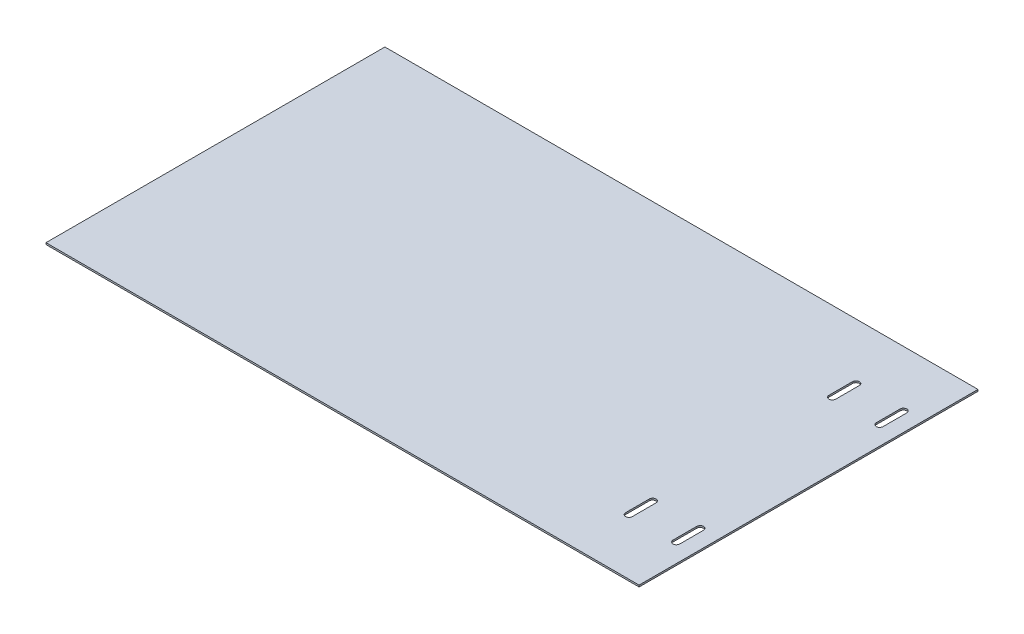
ISO-10303-21;
HEADER;
FILE_DESCRIPTION(('STEP AP214'),'2;1');
FILE_NAME('part.step','',(''),(''),'','','');
FILE_SCHEMA(('AUTOMOTIVE_DESIGN { 1 0 10303 214 1 1 1 1 }'));
ENDSEC;
DATA;
#1=APPLICATION_CONTEXT('core data for automotive mechanical design processes');
#2=APPLICATION_PROTOCOL_DEFINITION('international standard','automotive_design',2000,#1);
#3=PRODUCT_CONTEXT('',#1,'mechanical');
#4=PRODUCT('Part','Part','',(#3));
#5=PRODUCT_RELATED_PRODUCT_CATEGORY('part','',(#4));
#6=PRODUCT_DEFINITION_FORMATION('','',#4);
#7=PRODUCT_DEFINITION_CONTEXT('part definition',#1,'design');
#8=PRODUCT_DEFINITION('design','',#6,#7);
#9=PRODUCT_DEFINITION_SHAPE('','',#8);
#10=(LENGTH_UNIT() NAMED_UNIT(*) SI_UNIT(.MILLI.,.METRE.));
#11=(NAMED_UNIT(*) PLANE_ANGLE_UNIT() SI_UNIT($,.RADIAN.));
#12=(NAMED_UNIT(*) SI_UNIT($,.STERADIAN.) SOLID_ANGLE_UNIT());
#13=UNCERTAINTY_MEASURE_WITH_UNIT(LENGTH_MEASURE(1.E-05),#10,'distance_accuracy_value','');
#14=(GEOMETRIC_REPRESENTATION_CONTEXT(3) GLOBAL_UNCERTAINTY_ASSIGNED_CONTEXT((#13)) GLOBAL_UNIT_ASSIGNED_CONTEXT((#10,
#11,#12)) REPRESENTATION_CONTEXT('',''));
#15=CARTESIAN_POINT('',(0.,0.,0.));
#16=DIRECTION('',(0.,0.,1.));
#17=DIRECTION('',(1.,0.,0.));
#18=AXIS2_PLACEMENT_3D('',#15,#16,#17);
#19=CARTESIAN_POINT('',(176.119348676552,1.,100.));
#20=DIRECTION('',(-1.,0.,0.));
#21=DIRECTION('',(0.,0.,1.));
#22=AXIS2_PLACEMENT_3D('',#19,#20,#21);
#23=PLANE('',#22);
#24=DIRECTION('',(0.,0.,-1.));
#25=VECTOR('',#24,1.);
#26=CARTESIAN_POINT('',(176.119348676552,0.,100.));
#27=LINE('',#26,#25);
#28=CARTESIAN_POINT('',(176.119348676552,0.,100.));
#29=VERTEX_POINT('',#28);
#30=CARTESIAN_POINT('',(176.119348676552,0.,-100.));
#31=VERTEX_POINT('',#30);
#32=EDGE_CURVE('E303',#29,#31,#27,.T.);
#33=ORIENTED_EDGE('',*,*,#32,.T.);
#34=DIRECTION('',(0.,-1.,0.));
#35=VECTOR('',#34,1.);
#36=CARTESIAN_POINT('',(176.119348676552,1.,-100.));
#37=LINE('',#36,#35);
#38=CARTESIAN_POINT('',(176.119348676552,1.,-100.));
#39=VERTEX_POINT('',#38);
#40=EDGE_CURVE('E11',#39,#31,#37,.T.);
#41=ORIENTED_EDGE('',*,*,#40,.F.);
#42=DIRECTION('',(0.,0.,-1.));
#43=VECTOR('',#42,1.);
#44=CARTESIAN_POINT('',(176.119348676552,1.,100.));
#45=LINE('',#44,#43);
#46=CARTESIAN_POINT('',(176.119348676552,1.,100.));
#47=VERTEX_POINT('',#46);
#48=EDGE_CURVE('E310',#47,#39,#45,.T.);
#49=ORIENTED_EDGE('',*,*,#48,.F.);
#50=DIRECTION('',(0.,-1.,0.));
#51=VECTOR('',#50,1.);
#52=CARTESIAN_POINT('',(176.119348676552,1.,100.));
#53=LINE('',#52,#51);
#54=EDGE_CURVE('E320',#47,#29,#53,.T.);
#55=ORIENTED_EDGE('',*,*,#54,.T.);
#56=EDGE_LOOP('',(#33,#41,#49,#55));
#57=FACE_BOUND('',#56,.T.);
#58=ADVANCED_FACE('F42',(#57),#23,.F.);
#59=CARTESIAN_POINT('',(176.119348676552,1.,-100.));
#60=DIRECTION('',(0.,0.,1.));
#61=DIRECTION('',(1.,0.,0.));
#62=AXIS2_PLACEMENT_3D('',#59,#60,#61);
#63=PLANE('',#62);
#64=DIRECTION('',(-1.,0.,0.));
#65=VECTOR('',#64,1.);
#66=CARTESIAN_POINT('',(176.119348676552,0.,-100.));
#67=LINE('',#66,#65);
#68=CARTESIAN_POINT('',(-173.880651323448,0.,-100.));
#69=VERTEX_POINT('',#68);
#70=EDGE_CURVE('E323',#31,#69,#67,.T.);
#71=ORIENTED_EDGE('',*,*,#70,.T.);
#72=DIRECTION('',(0.,-1.,0.));
#73=VECTOR('',#72,1.);
#74=CARTESIAN_POINT('',(-173.880651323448,1.,-100.));
#75=LINE('',#74,#73);
#76=CARTESIAN_POINT('',(-173.880651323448,1.,-100.));
#77=VERTEX_POINT('',#76);
#78=EDGE_CURVE('E49',#77,#69,#75,.T.);
#79=ORIENTED_EDGE('',*,*,#78,.F.);
#80=DIRECTION('',(-1.,0.,0.));
#81=VECTOR('',#80,1.);
#82=CARTESIAN_POINT('',(176.119348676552,1.,-100.));
#83=LINE('',#82,#81);
#84=EDGE_CURVE('E313',#39,#77,#83,.T.);
#85=ORIENTED_EDGE('',*,*,#84,.F.);
#86=ORIENTED_EDGE('',*,*,#40,.T.);
#87=EDGE_LOOP('',(#71,#79,#85,#86));
#88=FACE_BOUND('',#87,.T.);
#89=ADVANCED_FACE('F352',(#88),#63,.F.);
#90=CARTESIAN_POINT('',(-173.880651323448,1.,-100.));
#91=DIRECTION('',(1.,0.,0.));
#92=DIRECTION('',(0.,0.,-1.));
#93=AXIS2_PLACEMENT_3D('',#90,#91,#92);
#94=PLANE('',#93);
#95=DIRECTION('',(0.,0.,1.));
#96=VECTOR('',#95,1.);
#97=CARTESIAN_POINT('',(-173.880651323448,0.,-100.));
#98=LINE('',#97,#96);
#99=CARTESIAN_POINT('',(-173.880651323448,0.,100.));
#100=VERTEX_POINT('',#99);
#101=EDGE_CURVE('E325',#69,#100,#98,.T.);
#102=ORIENTED_EDGE('',*,*,#101,.T.);
#103=DIRECTION('',(0.,-1.,0.));
#104=VECTOR('',#103,1.);
#105=CARTESIAN_POINT('',(-173.880651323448,1.,100.));
#106=LINE('',#105,#104);
#107=CARTESIAN_POINT('',(-173.880651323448,1.,100.));
#108=VERTEX_POINT('',#107);
#109=EDGE_CURVE('E330',#108,#100,#106,.T.);
#110=ORIENTED_EDGE('',*,*,#109,.F.);
#111=DIRECTION('',(0.,0.,1.));
#112=VECTOR('',#111,1.);
#113=CARTESIAN_POINT('',(-173.880651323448,1.,-100.));
#114=LINE('',#113,#112);
#115=EDGE_CURVE('E316',#77,#108,#114,.T.);
#116=ORIENTED_EDGE('',*,*,#115,.F.);
#117=ORIENTED_EDGE('',*,*,#78,.T.);
#118=EDGE_LOOP('',(#102,#110,#116,#117));
#119=FACE_BOUND('',#118,.T.);
#120=ADVANCED_FACE('F337',(#119),#94,.F.);
#121=CARTESIAN_POINT('',(-173.880651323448,1.,100.));
#122=DIRECTION('',(0.,0.,-1.));
#123=DIRECTION('',(-1.,0.,0.));
#124=AXIS2_PLACEMENT_3D('',#121,#122,#123);
#125=PLANE('',#124);
#126=DIRECTION('',(1.,0.,0.));
#127=VECTOR('',#126,1.);
#128=CARTESIAN_POINT('',(-173.880651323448,0.,100.));
#129=LINE('',#128,#127);
#130=EDGE_CURVE('E314',#100,#29,#129,.T.);
#131=ORIENTED_EDGE('',*,*,#130,.T.);
#132=ORIENTED_EDGE('',*,*,#54,.F.);
#133=DIRECTION('',(1.,0.,0.));
#134=VECTOR('',#133,1.);
#135=CARTESIAN_POINT('',(-173.880651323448,1.,100.));
#136=LINE('',#135,#134);
#137=EDGE_CURVE('E318',#108,#47,#136,.T.);
#138=ORIENTED_EDGE('',*,*,#137,.F.);
#139=ORIENTED_EDGE('',*,*,#109,.T.);
#140=EDGE_LOOP('',(#131,#132,#138,#139));
#141=FACE_BOUND('',#140,.T.);
#142=ADVANCED_FACE('F346',(#141),#125,.F.);
#143=CARTESIAN_POINT('',(0.,1.,0.));
#144=DIRECTION('',(0.,1.,0.));
#145=DIRECTION('',(0.,0.,1.));
#146=AXIS2_PLACEMENT_3D('',#143,#144,#145);
#147=PLANE('',#146);
#148=CARTESIAN_POINT('',(165.119348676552,1.,-67.));
#149=DIRECTION('',(0.,1.,0.));
#150=DIRECTION('',(0.,0.,1.));
#151=AXIS2_PLACEMENT_3D('',#148,#149,#150);
#152=CIRCLE('',#151,2.);
#153=CARTESIAN_POINT('',(167.119348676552,1.,-67.));
#154=VERTEX_POINT('',#153);
#155=CARTESIAN_POINT('',(163.119348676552,1.,-67.));
#156=VERTEX_POINT('',#155);
#157=EDGE_CURVE('E56',#154,#156,#152,.T.);
#158=ORIENTED_EDGE('',*,*,#157,.F.);
#159=DIRECTION('',(0.,0.,-1.));
#160=VECTOR('',#159,1.);
#161=CARTESIAN_POINT('',(167.119348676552,1.,-67.));
#162=LINE('',#161,#160);
#163=CARTESIAN_POINT('',(167.119348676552,1.,-53.));
#164=VERTEX_POINT('',#163);
#165=EDGE_CURVE('E259',#164,#154,#162,.T.);
#166=ORIENTED_EDGE('',*,*,#165,.F.);
#167=CARTESIAN_POINT('',(165.119348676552,1.,-53.));
#168=DIRECTION('',(0.,1.,0.));
#169=DIRECTION('',(0.,0.,1.));
#170=AXIS2_PLACEMENT_3D('',#167,#168,#169);
#171=CIRCLE('',#170,2.);
#172=CARTESIAN_POINT('',(163.119348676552,1.,-53.));
#173=VERTEX_POINT('',#172);
#174=EDGE_CURVE('E262',#173,#164,#171,.T.);
#175=ORIENTED_EDGE('',*,*,#174,.F.);
#176=DIRECTION('',(0.,0.,1.));
#177=VECTOR('',#176,1.);
#178=CARTESIAN_POINT('',(163.119348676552,1.,-67.));
#179=LINE('',#178,#177);
#180=EDGE_CURVE('E266',#156,#173,#179,.T.);
#181=ORIENTED_EDGE('',*,*,#180,.F.);
#182=EDGE_LOOP('',(#158,#166,#175,#181));
#183=FACE_BOUND('',#182,.T.);
#184=CARTESIAN_POINT('',(137.119348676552,1.,-67.));
#185=DIRECTION('',(0.,1.,0.));
#186=DIRECTION('',(0.,0.,-1.));
#187=AXIS2_PLACEMENT_3D('',#184,#185,#186);
#188=CIRCLE('',#187,2.);
#189=CARTESIAN_POINT('',(139.119348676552,1.,-67.));
#190=VERTEX_POINT('',#189);
#191=CARTESIAN_POINT('',(135.119348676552,1.,-67.));
#192=VERTEX_POINT('',#191);
#193=EDGE_CURVE('E64',#190,#192,#188,.T.);
#194=ORIENTED_EDGE('',*,*,#193,.F.);
#195=DIRECTION('',(0.,0.,-1.));
#196=VECTOR('',#195,1.);
#197=CARTESIAN_POINT('',(139.119348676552,1.,-67.));
#198=LINE('',#197,#196);
#199=CARTESIAN_POINT('',(139.119348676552,1.,-53.));
#200=VERTEX_POINT('',#199);
#201=EDGE_CURVE('E229',#200,#190,#198,.T.);
#202=ORIENTED_EDGE('',*,*,#201,.F.);
#203=CARTESIAN_POINT('',(137.119348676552,1.,-53.));
#204=DIRECTION('',(0.,1.,0.));
#205=DIRECTION('',(0.,0.,-1.));
#206=AXIS2_PLACEMENT_3D('',#203,#204,#205);
#207=CIRCLE('',#206,2.);
#208=CARTESIAN_POINT('',(135.119348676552,1.,-53.));
#209=VERTEX_POINT('',#208);
#210=EDGE_CURVE('E232',#209,#200,#207,.T.);
#211=ORIENTED_EDGE('',*,*,#210,.F.);
#212=DIRECTION('',(0.,0.,1.));
#213=VECTOR('',#212,1.);
#214=CARTESIAN_POINT('',(135.119348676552,1.,-67.));
#215=LINE('',#214,#213);
#216=EDGE_CURVE('E236',#192,#209,#215,.T.);
#217=ORIENTED_EDGE('',*,*,#216,.F.);
#218=EDGE_LOOP('',(#194,#202,#211,#217));
#219=FACE_BOUND('',#218,.T.);
#220=CARTESIAN_POINT('',(137.119348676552,1.,67.));
#221=DIRECTION('',(0.,1.,0.));
#222=DIRECTION('',(0.,0.,1.));
#223=AXIS2_PLACEMENT_3D('',#220,#221,#222);
#224=CIRCLE('',#223,2.);
#225=CARTESIAN_POINT('',(135.119348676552,1.,67.));
#226=VERTEX_POINT('',#225);
#227=CARTESIAN_POINT('',(139.119348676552,1.,67.));
#228=VERTEX_POINT('',#227);
#229=EDGE_CURVE('E181',#226,#228,#224,.T.);
#230=ORIENTED_EDGE('',*,*,#229,.F.);
#231=DIRECTION('',(0.,0.,1.));
#232=VECTOR('',#231,1.);
#233=CARTESIAN_POINT('',(135.119348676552,1.,67.));
#234=LINE('',#233,#232);
#235=CARTESIAN_POINT('',(135.119348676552,1.,53.));
#236=VERTEX_POINT('',#235);
#237=EDGE_CURVE('E191',#236,#226,#234,.T.);
#238=ORIENTED_EDGE('',*,*,#237,.F.);
#239=CARTESIAN_POINT('',(137.119348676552,1.,53.));
#240=DIRECTION('',(0.,1.,0.));
#241=DIRECTION('',(0.,0.,1.));
#242=AXIS2_PLACEMENT_3D('',#239,#240,#241);
#243=CIRCLE('',#242,2.);
#244=CARTESIAN_POINT('',(139.119348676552,1.,53.));
#245=VERTEX_POINT('',#244);
#246=EDGE_CURVE('E196',#245,#236,#243,.T.);
#247=ORIENTED_EDGE('',*,*,#246,.F.);
#248=DIRECTION('',(0.,0.,-1.));
#249=VECTOR('',#248,1.);
#250=CARTESIAN_POINT('',(139.119348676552,1.,67.));
#251=LINE('',#250,#249);
#252=EDGE_CURVE('E202',#228,#245,#251,.T.);
#253=ORIENTED_EDGE('',*,*,#252,.F.);
#254=EDGE_LOOP('',(#230,#238,#247,#253));
#255=FACE_BOUND('',#254,.T.);
#256=CARTESIAN_POINT('',(165.119348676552,1.,53.));
#257=DIRECTION('',(0.,1.,0.));
#258=DIRECTION('',(0.,0.,-1.));
#259=AXIS2_PLACEMENT_3D('',#256,#257,#258);
#260=CIRCLE('',#259,2.);
#261=CARTESIAN_POINT('',(167.119348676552,1.,53.));
#262=VERTEX_POINT('',#261);
#263=CARTESIAN_POINT('',(163.119348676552,1.,53.));
#264=VERTEX_POINT('',#263);
#265=EDGE_CURVE('E203',#262,#264,#260,.T.);
#266=ORIENTED_EDGE('',*,*,#265,.F.);
#267=DIRECTION('',(0.,0.,-1.));
#268=VECTOR('',#267,1.);
#269=CARTESIAN_POINT('',(167.119348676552,1.,67.));
#270=LINE('',#269,#268);
#271=CARTESIAN_POINT('',(167.119348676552,1.,67.));
#272=VERTEX_POINT('',#271);
#273=EDGE_CURVE('E284',#272,#262,#270,.T.);
#274=ORIENTED_EDGE('',*,*,#273,.F.);
#275=CARTESIAN_POINT('',(165.119348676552,1.,67.));
#276=DIRECTION('',(0.,1.,0.));
#277=DIRECTION('',(0.,0.,-1.));
#278=AXIS2_PLACEMENT_3D('',#275,#276,#277);
#279=CIRCLE('',#278,2.);
#280=CARTESIAN_POINT('',(163.119348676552,1.,67.));
#281=VERTEX_POINT('',#280);
#282=EDGE_CURVE('E296',#281,#272,#279,.T.);
#283=ORIENTED_EDGE('',*,*,#282,.F.);
#284=DIRECTION('',(0.,0.,1.));
#285=VECTOR('',#284,1.);
#286=CARTESIAN_POINT('',(163.119348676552,1.,67.));
#287=LINE('',#286,#285);
#288=EDGE_CURVE('E205',#264,#281,#287,.T.);
#289=ORIENTED_EDGE('',*,*,#288,.F.);
#290=EDGE_LOOP('',(#266,#274,#283,#289));
#291=FACE_BOUND('',#290,.T.);
#292=ORIENTED_EDGE('',*,*,#48,.T.);
#293=ORIENTED_EDGE('',*,*,#84,.T.);
#294=ORIENTED_EDGE('',*,*,#115,.T.);
#295=ORIENTED_EDGE('',*,*,#137,.T.);
#296=EDGE_LOOP('',(#292,#293,#294,#295));
#297=FACE_BOUND('',#296,.T.);
#298=ADVANCED_FACE('F199',(#183,#219,#255,#291,#297),#147,.T.);
#299=CARTESIAN_POINT('',(0.,0.,0.));
#300=DIRECTION('',(0.,1.,0.));
#301=DIRECTION('',(0.,0.,1.));
#302=AXIS2_PLACEMENT_3D('',#299,#300,#301);
#303=PLANE('',#302);
#304=DIRECTION('',(0.,0.,-1.));
#305=VECTOR('',#304,1.);
#306=CARTESIAN_POINT('',(167.119348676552,0.,-67.));
#307=LINE('',#306,#305);
#308=CARTESIAN_POINT('',(167.119348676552,0.,-53.));
#309=VERTEX_POINT('',#308);
#310=CARTESIAN_POINT('',(167.119348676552,0.,-67.));
#311=VERTEX_POINT('',#310);
#312=EDGE_CURVE('E252',#309,#311,#307,.T.);
#313=ORIENTED_EDGE('',*,*,#312,.T.);
#314=CARTESIAN_POINT('',(165.119348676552,0.,-67.));
#315=DIRECTION('',(0.,1.,0.));
#316=DIRECTION('',(0.,0.,1.));
#317=AXIS2_PLACEMENT_3D('',#314,#315,#316);
#318=CIRCLE('',#317,2.);
#319=CARTESIAN_POINT('',(163.119348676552,0.,-67.));
#320=VERTEX_POINT('',#319);
#321=EDGE_CURVE('E263',#311,#320,#318,.T.);
#322=ORIENTED_EDGE('',*,*,#321,.T.);
#323=DIRECTION('',(0.,0.,1.));
#324=VECTOR('',#323,1.);
#325=CARTESIAN_POINT('',(163.119348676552,0.,-67.));
#326=LINE('',#325,#324);
#327=CARTESIAN_POINT('',(163.119348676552,0.,-53.));
#328=VERTEX_POINT('',#327);
#329=EDGE_CURVE('E275',#320,#328,#326,.T.);
#330=ORIENTED_EDGE('',*,*,#329,.T.);
#331=CARTESIAN_POINT('',(165.119348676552,0.,-53.));
#332=DIRECTION('',(0.,1.,0.));
#333=DIRECTION('',(0.,0.,1.));
#334=AXIS2_PLACEMENT_3D('',#331,#332,#333);
#335=CIRCLE('',#334,2.);
#336=EDGE_CURVE('E272',#328,#309,#335,.T.);
#337=ORIENTED_EDGE('',*,*,#336,.T.);
#338=EDGE_LOOP('',(#313,#322,#330,#337));
#339=FACE_BOUND('',#338,.T.);
#340=DIRECTION('',(0.,0.,-1.));
#341=VECTOR('',#340,1.);
#342=CARTESIAN_POINT('',(139.119348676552,0.,-67.));
#343=LINE('',#342,#341);
#344=CARTESIAN_POINT('',(139.119348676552,0.,-53.));
#345=VERTEX_POINT('',#344);
#346=CARTESIAN_POINT('',(139.119348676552,0.,-67.));
#347=VERTEX_POINT('',#346);
#348=EDGE_CURVE('E222',#345,#347,#343,.T.);
#349=ORIENTED_EDGE('',*,*,#348,.T.);
#350=CARTESIAN_POINT('',(137.119348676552,0.,-67.));
#351=DIRECTION('',(0.,1.,0.));
#352=DIRECTION('',(0.,0.,-1.));
#353=AXIS2_PLACEMENT_3D('',#350,#351,#352);
#354=CIRCLE('',#353,2.);
#355=CARTESIAN_POINT('',(135.119348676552,0.,-67.));
#356=VERTEX_POINT('',#355);
#357=EDGE_CURVE('E233',#347,#356,#354,.T.);
#358=ORIENTED_EDGE('',*,*,#357,.T.);
#359=DIRECTION('',(0.,0.,1.));
#360=VECTOR('',#359,1.);
#361=CARTESIAN_POINT('',(135.119348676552,0.,-67.));
#362=LINE('',#361,#360);
#363=CARTESIAN_POINT('',(135.119348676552,0.,-53.));
#364=VERTEX_POINT('',#363);
#365=EDGE_CURVE('E245',#356,#364,#362,.T.);
#366=ORIENTED_EDGE('',*,*,#365,.T.);
#367=CARTESIAN_POINT('',(137.119348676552,0.,-53.));
#368=DIRECTION('',(0.,1.,0.));
#369=DIRECTION('',(0.,0.,-1.));
#370=AXIS2_PLACEMENT_3D('',#367,#368,#369);
#371=CIRCLE('',#370,2.);
#372=EDGE_CURVE('E242',#364,#345,#371,.T.);
#373=ORIENTED_EDGE('',*,*,#372,.T.);
#374=EDGE_LOOP('',(#349,#358,#366,#373));
#375=FACE_BOUND('',#374,.T.);
#376=DIRECTION('',(0.,0.,1.));
#377=VECTOR('',#376,1.);
#378=CARTESIAN_POINT('',(135.119348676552,0.,67.));
#379=LINE('',#378,#377);
#380=CARTESIAN_POINT('',(135.119348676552,0.,53.));
#381=VERTEX_POINT('',#380);
#382=CARTESIAN_POINT('',(135.119348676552,0.,67.));
#383=VERTEX_POINT('',#382);
#384=EDGE_CURVE('E210',#381,#383,#379,.T.);
#385=ORIENTED_EDGE('',*,*,#384,.T.);
#386=CARTESIAN_POINT('',(137.119348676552,0.,67.));
#387=DIRECTION('',(0.,1.,0.));
#388=DIRECTION('',(0.,0.,1.));
#389=AXIS2_PLACEMENT_3D('',#386,#387,#388);
#390=CIRCLE('',#389,2.);
#391=CARTESIAN_POINT('',(139.119348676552,0.,67.));
#392=VERTEX_POINT('',#391);
#393=EDGE_CURVE('E184',#383,#392,#390,.T.);
#394=ORIENTED_EDGE('',*,*,#393,.T.);
#395=DIRECTION('',(0.,0.,-1.));
#396=VECTOR('',#395,1.);
#397=CARTESIAN_POINT('',(139.119348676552,0.,67.));
#398=LINE('',#397,#396);
#399=CARTESIAN_POINT('',(139.119348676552,0.,53.));
#400=VERTEX_POINT('',#399);
#401=EDGE_CURVE('E216',#392,#400,#398,.T.);
#402=ORIENTED_EDGE('',*,*,#401,.T.);
#403=CARTESIAN_POINT('',(137.119348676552,0.,53.));
#404=DIRECTION('',(0.,1.,0.));
#405=DIRECTION('',(0.,0.,1.));
#406=AXIS2_PLACEMENT_3D('',#403,#404,#405);
#407=CIRCLE('',#406,2.);
#408=EDGE_CURVE('E212',#400,#381,#407,.T.);
#409=ORIENTED_EDGE('',*,*,#408,.T.);
#410=EDGE_LOOP('',(#385,#394,#402,#409));
#411=FACE_BOUND('',#410,.T.);
#412=DIRECTION('',(0.,0.,-1.));
#413=VECTOR('',#412,1.);
#414=CARTESIAN_POINT('',(167.119348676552,0.,67.));
#415=LINE('',#414,#413);
#416=CARTESIAN_POINT('',(167.119348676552,0.,67.));
#417=VERTEX_POINT('',#416);
#418=CARTESIAN_POINT('',(167.119348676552,0.,53.));
#419=VERTEX_POINT('',#418);
#420=EDGE_CURVE('E290',#417,#419,#415,.T.);
#421=ORIENTED_EDGE('',*,*,#420,.T.);
#422=CARTESIAN_POINT('',(165.119348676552,0.,53.));
#423=DIRECTION('',(0.,1.,0.));
#424=DIRECTION('',(0.,0.,-1.));
#425=AXIS2_PLACEMENT_3D('',#422,#423,#424);
#426=CIRCLE('',#425,2.);
#427=CARTESIAN_POINT('',(163.119348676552,0.,53.));
#428=VERTEX_POINT('',#427);
#429=EDGE_CURVE('E280',#419,#428,#426,.T.);
#430=ORIENTED_EDGE('',*,*,#429,.T.);
#431=DIRECTION('',(0.,0.,1.));
#432=VECTOR('',#431,1.);
#433=CARTESIAN_POINT('',(163.119348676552,0.,67.));
#434=LINE('',#433,#432);
#435=CARTESIAN_POINT('',(163.119348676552,0.,67.));
#436=VERTEX_POINT('',#435);
#437=EDGE_CURVE('E283',#428,#436,#434,.T.);
#438=ORIENTED_EDGE('',*,*,#437,.T.);
#439=CARTESIAN_POINT('',(165.119348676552,0.,67.));
#440=DIRECTION('',(0.,1.,0.));
#441=DIRECTION('',(0.,0.,-1.));
#442=AXIS2_PLACEMENT_3D('',#439,#440,#441);
#443=CIRCLE('',#442,2.);
#444=EDGE_CURVE('E287',#436,#417,#443,.T.);
#445=ORIENTED_EDGE('',*,*,#444,.T.);
#446=EDGE_LOOP('',(#421,#430,#438,#445));
#447=FACE_BOUND('',#446,.T.);
#448=ORIENTED_EDGE('',*,*,#32,.F.);
#449=ORIENTED_EDGE('',*,*,#130,.F.);
#450=ORIENTED_EDGE('',*,*,#101,.F.);
#451=ORIENTED_EDGE('',*,*,#70,.F.);
#452=EDGE_LOOP('',(#448,#449,#450,#451));
#453=FACE_BOUND('',#452,.T.);
#454=ADVANCED_FACE('F343',(#339,#375,#411,#447,#453),#303,.F.);
#455=CARTESIAN_POINT('',(165.119348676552,0.,53.));
#456=DIRECTION('',(0.,1.,0.));
#457=DIRECTION('',(0.,0.,1.));
#458=AXIS2_PLACEMENT_3D('',#455,#456,#457);
#459=CYLINDRICAL_SURFACE('',#458,2.);
#460=ORIENTED_EDGE('',*,*,#265,.T.);
#461=DIRECTION('',(0.,1.,0.));
#462=VECTOR('',#461,1.);
#463=CARTESIAN_POINT('',(163.119348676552,0.,53.));
#464=LINE('',#463,#462);
#465=EDGE_CURVE('E292',#428,#264,#464,.T.);
#466=ORIENTED_EDGE('',*,*,#465,.F.);
#467=ORIENTED_EDGE('',*,*,#429,.F.);
#468=DIRECTION('',(0.,1.,0.));
#469=VECTOR('',#468,1.);
#470=CARTESIAN_POINT('',(167.119348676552,0.,53.));
#471=LINE('',#470,#469);
#472=EDGE_CURVE('E301',#419,#262,#471,.T.);
#473=ORIENTED_EDGE('',*,*,#472,.T.);
#474=EDGE_LOOP('',(#460,#466,#467,#473));
#475=FACE_BOUND('',#474,.T.);
#476=ADVANCED_FACE('F364',(#475),#459,.F.);
#477=CARTESIAN_POINT('',(167.119348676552,0.,67.));
#478=DIRECTION('',(1.,0.,0.));
#479=DIRECTION('',(0.,0.,-1.));
#480=AXIS2_PLACEMENT_3D('',#477,#478,#479);
#481=PLANE('',#480);
#482=ORIENTED_EDGE('',*,*,#273,.T.);
#483=ORIENTED_EDGE('',*,*,#472,.F.);
#484=ORIENTED_EDGE('',*,*,#420,.F.);
#485=DIRECTION('',(0.,1.,0.));
#486=VECTOR('',#485,1.);
#487=CARTESIAN_POINT('',(167.119348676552,0.,67.));
#488=LINE('',#487,#486);
#489=EDGE_CURVE('E304',#417,#272,#488,.T.);
#490=ORIENTED_EDGE('',*,*,#489,.T.);
#491=EDGE_LOOP('',(#482,#483,#484,#490));
#492=FACE_BOUND('',#491,.T.);
#493=ADVANCED_FACE('F371',(#492),#481,.F.);
#494=CARTESIAN_POINT('',(165.119348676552,0.,67.));
#495=DIRECTION('',(0.,1.,0.));
#496=DIRECTION('',(0.,0.,1.));
#497=AXIS2_PLACEMENT_3D('',#494,#495,#496);
#498=CYLINDRICAL_SURFACE('',#497,2.);
#499=ORIENTED_EDGE('',*,*,#282,.T.);
#500=ORIENTED_EDGE('',*,*,#489,.F.);
#501=ORIENTED_EDGE('',*,*,#444,.F.);
#502=DIRECTION('',(0.,1.,0.));
#503=VECTOR('',#502,1.);
#504=CARTESIAN_POINT('',(163.119348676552,0.,67.));
#505=LINE('',#504,#503);
#506=EDGE_CURVE('E306',#436,#281,#505,.T.);
#507=ORIENTED_EDGE('',*,*,#506,.T.);
#508=EDGE_LOOP('',(#499,#500,#501,#507));
#509=FACE_BOUND('',#508,.T.);
#510=ADVANCED_FACE('F376',(#509),#498,.F.);
#511=CARTESIAN_POINT('',(163.119348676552,0.,67.));
#512=DIRECTION('',(-1.,0.,0.));
#513=DIRECTION('',(0.,0.,1.));
#514=AXIS2_PLACEMENT_3D('',#511,#512,#513);
#515=PLANE('',#514);
#516=ORIENTED_EDGE('',*,*,#288,.T.);
#517=ORIENTED_EDGE('',*,*,#506,.F.);
#518=ORIENTED_EDGE('',*,*,#437,.F.);
#519=ORIENTED_EDGE('',*,*,#465,.T.);
#520=EDGE_LOOP('',(#516,#517,#518,#519));
#521=FACE_BOUND('',#520,.T.);
#522=ADVANCED_FACE('F373',(#521),#515,.F.);
#523=CARTESIAN_POINT('',(137.119348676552,0.,67.));
#524=DIRECTION('',(0.,1.,0.));
#525=DIRECTION('',(0.,0.,1.));
#526=AXIS2_PLACEMENT_3D('',#523,#524,#525);
#527=CYLINDRICAL_SURFACE('',#526,2.);
#528=ORIENTED_EDGE('',*,*,#229,.T.);
#529=DIRECTION('',(0.,1.,0.));
#530=VECTOR('',#529,1.);
#531=CARTESIAN_POINT('',(139.119348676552,0.,67.));
#532=LINE('',#531,#530);
#533=EDGE_CURVE('E213',#392,#228,#532,.T.);
#534=ORIENTED_EDGE('',*,*,#533,.F.);
#535=ORIENTED_EDGE('',*,*,#393,.F.);
#536=DIRECTION('',(0.,1.,0.));
#537=VECTOR('',#536,1.);
#538=CARTESIAN_POINT('',(135.119348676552,0.,67.));
#539=LINE('',#538,#537);
#540=EDGE_CURVE('E177',#383,#226,#539,.T.);
#541=ORIENTED_EDGE('',*,*,#540,.T.);
#542=EDGE_LOOP('',(#528,#534,#535,#541));
#543=FACE_BOUND('',#542,.T.);
#544=ADVANCED_FACE('F179',(#543),#527,.F.);
#545=CARTESIAN_POINT('',(135.119348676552,0.,67.));
#546=DIRECTION('',(-1.,0.,0.));
#547=DIRECTION('',(0.,0.,1.));
#548=AXIS2_PLACEMENT_3D('',#545,#546,#547);
#549=PLANE('',#548);
#550=ORIENTED_EDGE('',*,*,#237,.T.);
#551=ORIENTED_EDGE('',*,*,#540,.F.);
#552=ORIENTED_EDGE('',*,*,#384,.F.);
#553=DIRECTION('',(0.,1.,0.));
#554=VECTOR('',#553,1.);
#555=CARTESIAN_POINT('',(135.119348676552,0.,53.));
#556=LINE('',#555,#554);
#557=EDGE_CURVE('E188',#381,#236,#556,.T.);
#558=ORIENTED_EDGE('',*,*,#557,.T.);
#559=EDGE_LOOP('',(#550,#551,#552,#558));
#560=FACE_BOUND('',#559,.T.);
#561=ADVANCED_FACE('F192',(#560),#549,.F.);
#562=CARTESIAN_POINT('',(137.119348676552,0.,53.));
#563=DIRECTION('',(0.,1.,0.));
#564=DIRECTION('',(0.,0.,1.));
#565=AXIS2_PLACEMENT_3D('',#562,#563,#564);
#566=CYLINDRICAL_SURFACE('',#565,2.);
#567=ORIENTED_EDGE('',*,*,#246,.T.);
#568=ORIENTED_EDGE('',*,*,#557,.F.);
#569=ORIENTED_EDGE('',*,*,#408,.F.);
#570=DIRECTION('',(0.,1.,0.));
#571=VECTOR('',#570,1.);
#572=CARTESIAN_POINT('',(139.119348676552,0.,53.));
#573=LINE('',#572,#571);
#574=EDGE_CURVE('E645',#400,#245,#573,.T.);
#575=ORIENTED_EDGE('',*,*,#574,.T.);
#576=EDGE_LOOP('',(#567,#568,#569,#575));
#577=FACE_BOUND('',#576,.T.);
#578=ADVANCED_FACE('F417',(#577),#566,.F.);
#579=CARTESIAN_POINT('',(139.119348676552,0.,67.));
#580=DIRECTION('',(1.,0.,0.));
#581=DIRECTION('',(0.,0.,-1.));
#582=AXIS2_PLACEMENT_3D('',#579,#580,#581);
#583=PLANE('',#582);
#584=ORIENTED_EDGE('',*,*,#252,.T.);
#585=ORIENTED_EDGE('',*,*,#574,.F.);
#586=ORIENTED_EDGE('',*,*,#401,.F.);
#587=ORIENTED_EDGE('',*,*,#533,.T.);
#588=EDGE_LOOP('',(#584,#585,#586,#587));
#589=FACE_BOUND('',#588,.T.);
#590=ADVANCED_FACE('F414',(#589),#583,.F.);
#591=CARTESIAN_POINT('',(137.119348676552,0.,-67.));
#592=DIRECTION('',(0.,1.,0.));
#593=DIRECTION('',(0.,0.,1.));
#594=AXIS2_PLACEMENT_3D('',#591,#592,#593);
#595=CYLINDRICAL_SURFACE('',#594,2.);
#596=ORIENTED_EDGE('',*,*,#193,.T.);
#597=DIRECTION('',(0.,1.,0.));
#598=VECTOR('',#597,1.);
#599=CARTESIAN_POINT('',(135.119348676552,0.,-67.));
#600=LINE('',#599,#598);
#601=EDGE_CURVE('E220',#356,#192,#600,.T.);
#602=ORIENTED_EDGE('',*,*,#601,.F.);
#603=ORIENTED_EDGE('',*,*,#357,.F.);
#604=DIRECTION('',(0.,1.,0.));
#605=VECTOR('',#604,1.);
#606=CARTESIAN_POINT('',(139.119348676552,0.,-67.));
#607=LINE('',#606,#605);
#608=EDGE_CURVE('E227',#347,#190,#607,.T.);
#609=ORIENTED_EDGE('',*,*,#608,.T.);
#610=EDGE_LOOP('',(#596,#602,#603,#609));
#611=FACE_BOUND('',#610,.T.);
#612=ADVANCED_FACE('F404',(#611),#595,.F.);
#613=CARTESIAN_POINT('',(139.119348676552,0.,-67.));
#614=DIRECTION('',(1.,0.,0.));
#615=DIRECTION('',(0.,0.,-1.));
#616=AXIS2_PLACEMENT_3D('',#613,#614,#615);
#617=PLANE('',#616);
#618=ORIENTED_EDGE('',*,*,#201,.T.);
#619=ORIENTED_EDGE('',*,*,#608,.F.);
#620=ORIENTED_EDGE('',*,*,#348,.F.);
#621=DIRECTION('',(0.,1.,0.));
#622=VECTOR('',#621,1.);
#623=CARTESIAN_POINT('',(139.119348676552,0.,-53.));
#624=LINE('',#623,#622);
#625=EDGE_CURVE('E225',#345,#200,#624,.T.);
#626=ORIENTED_EDGE('',*,*,#625,.T.);
#627=EDGE_LOOP('',(#618,#619,#620,#626));
#628=FACE_BOUND('',#627,.T.);
#629=ADVANCED_FACE('F400',(#628),#617,.F.);
#630=CARTESIAN_POINT('',(137.119348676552,0.,-53.));
#631=DIRECTION('',(0.,1.,0.));
#632=DIRECTION('',(0.,0.,1.));
#633=AXIS2_PLACEMENT_3D('',#630,#631,#632);
#634=CYLINDRICAL_SURFACE('',#633,2.);
#635=ORIENTED_EDGE('',*,*,#210,.T.);
#636=ORIENTED_EDGE('',*,*,#625,.F.);
#637=ORIENTED_EDGE('',*,*,#372,.F.);
#638=DIRECTION('',(0.,1.,0.));
#639=VECTOR('',#638,1.);
#640=CARTESIAN_POINT('',(135.119348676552,0.,-53.));
#641=LINE('',#640,#639);
#642=EDGE_CURVE('E223',#364,#209,#641,.T.);
#643=ORIENTED_EDGE('',*,*,#642,.T.);
#644=EDGE_LOOP('',(#635,#636,#637,#643));
#645=FACE_BOUND('',#644,.T.);
#646=ADVANCED_FACE('F403',(#645),#634,.F.);
#647=CARTESIAN_POINT('',(135.119348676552,0.,-67.));
#648=DIRECTION('',(-1.,0.,0.));
#649=DIRECTION('',(0.,0.,1.));
#650=AXIS2_PLACEMENT_3D('',#647,#648,#649);
#651=PLANE('',#650);
#652=ORIENTED_EDGE('',*,*,#216,.T.);
#653=ORIENTED_EDGE('',*,*,#642,.F.);
#654=ORIENTED_EDGE('',*,*,#365,.F.);
#655=ORIENTED_EDGE('',*,*,#601,.T.);
#656=EDGE_LOOP('',(#652,#653,#654,#655));
#657=FACE_BOUND('',#656,.T.);
#658=ADVANCED_FACE('F399',(#657),#651,.F.);
#659=CARTESIAN_POINT('',(165.119348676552,0.,-67.));
#660=DIRECTION('',(0.,1.,0.));
#661=DIRECTION('',(0.,0.,1.));
#662=AXIS2_PLACEMENT_3D('',#659,#660,#661);
#663=CYLINDRICAL_SURFACE('',#662,2.);
#664=ORIENTED_EDGE('',*,*,#157,.T.);
#665=DIRECTION('',(0.,1.,0.));
#666=VECTOR('',#665,1.);
#667=CARTESIAN_POINT('',(163.119348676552,0.,-67.));
#668=LINE('',#667,#666);
#669=EDGE_CURVE('E250',#320,#156,#668,.T.);
#670=ORIENTED_EDGE('',*,*,#669,.F.);
#671=ORIENTED_EDGE('',*,*,#321,.F.);
#672=DIRECTION('',(0.,1.,0.));
#673=VECTOR('',#672,1.);
#674=CARTESIAN_POINT('',(167.119348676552,0.,-67.));
#675=LINE('',#674,#673);
#676=EDGE_CURVE('E257',#311,#154,#675,.T.);
#677=ORIENTED_EDGE('',*,*,#676,.T.);
#678=EDGE_LOOP('',(#664,#670,#671,#677));
#679=FACE_BOUND('',#678,.T.);
#680=ADVANCED_FACE('F388',(#679),#663,.F.);
#681=CARTESIAN_POINT('',(167.119348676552,0.,-67.));
#682=DIRECTION('',(1.,0.,0.));
#683=DIRECTION('',(0.,0.,-1.));
#684=AXIS2_PLACEMENT_3D('',#681,#682,#683);
#685=PLANE('',#684);
#686=ORIENTED_EDGE('',*,*,#165,.T.);
#687=ORIENTED_EDGE('',*,*,#676,.F.);
#688=ORIENTED_EDGE('',*,*,#312,.F.);
#689=DIRECTION('',(0.,1.,0.));
#690=VECTOR('',#689,1.);
#691=CARTESIAN_POINT('',(167.119348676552,0.,-53.));
#692=LINE('',#691,#690);
#693=EDGE_CURVE('E255',#309,#164,#692,.T.);
#694=ORIENTED_EDGE('',*,*,#693,.T.);
#695=EDGE_LOOP('',(#686,#687,#688,#694));
#696=FACE_BOUND('',#695,.T.);
#697=ADVANCED_FACE('F384',(#696),#685,.F.);
#698=CARTESIAN_POINT('',(165.119348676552,0.,-53.));
#699=DIRECTION('',(0.,1.,0.));
#700=DIRECTION('',(0.,0.,1.));
#701=AXIS2_PLACEMENT_3D('',#698,#699,#700);
#702=CYLINDRICAL_SURFACE('',#701,2.);
#703=ORIENTED_EDGE('',*,*,#174,.T.);
#704=ORIENTED_EDGE('',*,*,#693,.F.);
#705=ORIENTED_EDGE('',*,*,#336,.F.);
#706=DIRECTION('',(0.,1.,0.));
#707=VECTOR('',#706,1.);
#708=CARTESIAN_POINT('',(163.119348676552,0.,-53.));
#709=LINE('',#708,#707);
#710=EDGE_CURVE('E253',#328,#173,#709,.T.);
#711=ORIENTED_EDGE('',*,*,#710,.T.);
#712=EDGE_LOOP('',(#703,#704,#705,#711));
#713=FACE_BOUND('',#712,.T.);
#714=ADVANCED_FACE('F387',(#713),#702,.F.);
#715=CARTESIAN_POINT('',(163.119348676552,0.,-67.));
#716=DIRECTION('',(-1.,0.,0.));
#717=DIRECTION('',(0.,0.,1.));
#718=AXIS2_PLACEMENT_3D('',#715,#716,#717);
#719=PLANE('',#718);
#720=ORIENTED_EDGE('',*,*,#180,.T.);
#721=ORIENTED_EDGE('',*,*,#710,.F.);
#722=ORIENTED_EDGE('',*,*,#329,.F.);
#723=ORIENTED_EDGE('',*,*,#669,.T.);
#724=EDGE_LOOP('',(#720,#721,#722,#723));
#725=FACE_BOUND('',#724,.T.);
#726=ADVANCED_FACE('F392',(#725),#719,.F.);
#727=CLOSED_SHELL('',(#58,#89,#120,#142,#298,#454,#476,#493,#510,#522,#544,#561,#578,#590,#612,
#629,#646,#658,#680,#697,#714,#726));
#728=MANIFOLD_SOLID_BREP('B2',#727);
#729=ADVANCED_BREP_SHAPE_REPRESENTATION('',(#18,#728),#14);
#730=SHAPE_DEFINITION_REPRESENTATION(#9,#729);
ENDSEC;
END-ISO-10303-21;
